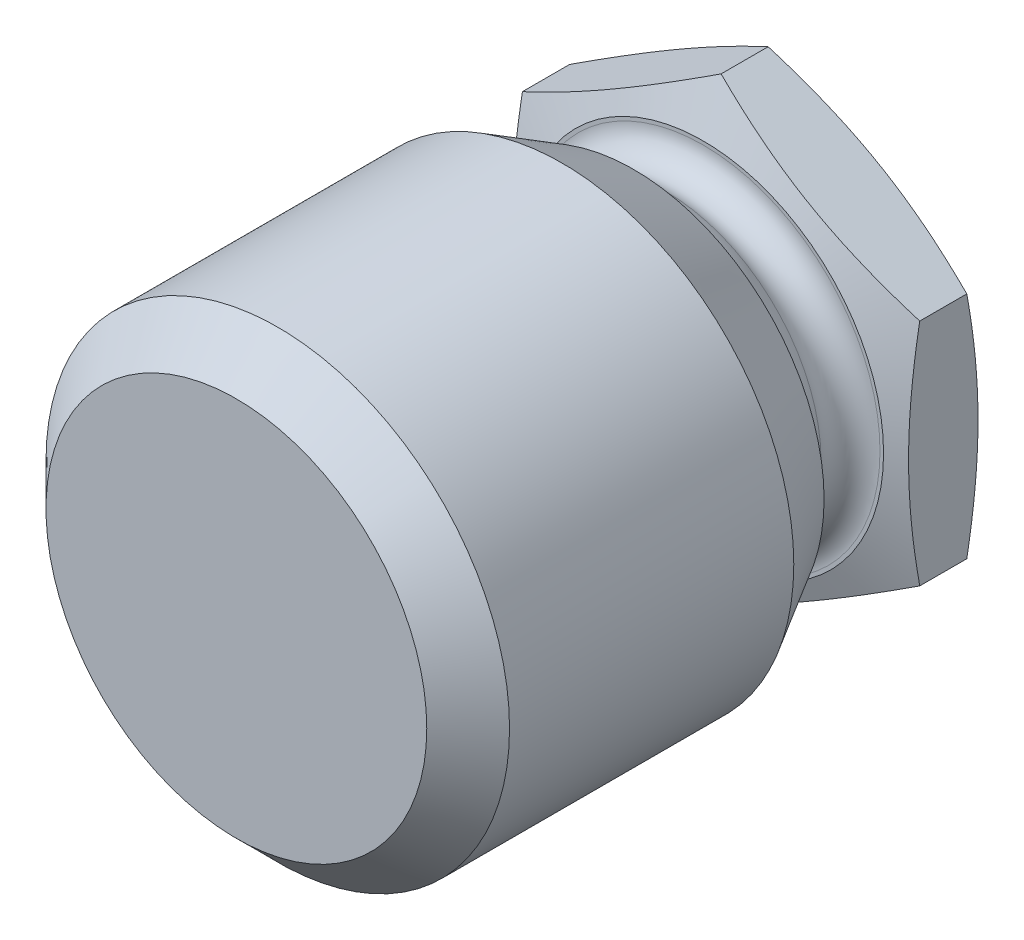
ISO-10303-21;
HEADER;
FILE_DESCRIPTION(('STEP AP214'),'2;1');
FILE_NAME('part.step','',(''),(''),'','','');
FILE_SCHEMA(('AUTOMOTIVE_DESIGN { 1 0 10303 214 1 1 1 1 }'));
ENDSEC;
DATA;
#1=APPLICATION_CONTEXT('core data for automotive mechanical design processes');
#2=APPLICATION_PROTOCOL_DEFINITION('international standard','automotive_design',2000,#1);
#3=PRODUCT_CONTEXT('',#1,'mechanical');
#4=PRODUCT('Part','Part','',(#3));
#5=PRODUCT_RELATED_PRODUCT_CATEGORY('part','',(#4));
#6=PRODUCT_DEFINITION_FORMATION('','',#4);
#7=PRODUCT_DEFINITION_CONTEXT('part definition',#1,'design');
#8=PRODUCT_DEFINITION('design','',#6,#7);
#9=PRODUCT_DEFINITION_SHAPE('','',#8);
#10=(LENGTH_UNIT() NAMED_UNIT(*) SI_UNIT(.MILLI.,.METRE.));
#11=(NAMED_UNIT(*) PLANE_ANGLE_UNIT() SI_UNIT($,.RADIAN.));
#12=(NAMED_UNIT(*) SI_UNIT($,.STERADIAN.) SOLID_ANGLE_UNIT());
#13=UNCERTAINTY_MEASURE_WITH_UNIT(LENGTH_MEASURE(1.E-05),#10,'distance_accuracy_value','');
#14=(GEOMETRIC_REPRESENTATION_CONTEXT(3) GLOBAL_UNCERTAINTY_ASSIGNED_CONTEXT((#13)) GLOBAL_UNIT_ASSIGNED_CONTEXT((#10,
#11,#12)) REPRESENTATION_CONTEXT('',''));
#15=CARTESIAN_POINT('',(0.,0.,0.));
#16=DIRECTION('',(0.,0.,1.));
#17=DIRECTION('',(1.,0.,0.));
#18=AXIS2_PLACEMENT_3D('',#15,#16,#17);
#19=CARTESIAN_POINT('',(0.,0.,3.9211552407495));
#20=DIRECTION('',(0.,0.,-1.));
#21=DIRECTION('',(-1.,0.,0.));
#22=AXIS2_PLACEMENT_3D('',#19,#20,#21);
#23=CONICAL_SURFACE('',#22,13.856406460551,1.22173047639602);
#24=CARTESIAN_POINT('',(0.,0.,5.));
#25=DIRECTION('',(0.,0.,1.));
#26=DIRECTION('',(1.,0.,0.));
#27=AXIS2_PLACEMENT_3D('',#24,#25,#26);
#28=CIRCLE('',#27,10.8923048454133);
#29=CARTESIAN_POINT('',(10.8923048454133,0.,5.));
#30=VERTEX_POINT('',#29);
#31=EDGE_CURVE('E205',#30,#30,#28,.T.);
#32=ORIENTED_EDGE('',*,*,#31,.F.);
#33=EDGE_LOOP('',(#32));
#34=FACE_BOUND('',#33,.T.);
#35=CARTESIAN_POINT('',(-12.0002,6.92808776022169,3.92111321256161));
#36=CARTESIAN_POINT('',(-11.5032371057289,7.21500942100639,4.02558110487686));
#37=CARTESIAN_POINT('',(-11.0046354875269,7.5028771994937,4.1206125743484));
#38=CARTESIAN_POINT('',(-10.0041904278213,8.08048442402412,4.28780554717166));
#39=CARTESIAN_POINT('',(-9.50234476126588,8.37022515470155,4.35994915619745));
#40=CARTESIAN_POINT('',(-8.50098069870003,8.94836296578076,4.47663930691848));
#41=CARTESIAN_POINT('',(-8.00148516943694,9.23674684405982,4.52144035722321));
#42=CARTESIAN_POINT('',(-7.00132608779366,9.81418895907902,4.5815311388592));
#43=CARTESIAN_POINT('',(-6.50066304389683,10.1032469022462,4.59683193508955));
#44=CARTESIAN_POINT('',(-5.49933695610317,10.6813627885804,4.59683193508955));
#45=CARTESIAN_POINT('',(-4.99867391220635,10.9704207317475,4.5815311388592));
#46=CARTESIAN_POINT('',(-3.99851483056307,11.5478628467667,4.52144035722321));
#47=CARTESIAN_POINT('',(-3.49901930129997,11.8362467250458,4.47663930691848));
#48=CARTESIAN_POINT('',(-2.49765523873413,12.414384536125,4.35994915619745));
#49=CARTESIAN_POINT('',(-1.99580957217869,12.7041252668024,4.28780554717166));
#50=CARTESIAN_POINT('',(-0.995364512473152,13.2817324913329,4.1206125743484));
#51=CARTESIAN_POINT('',(-0.496762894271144,13.5696002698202,4.02558110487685));
#52=CARTESIAN_POINT('',(0.000200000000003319,13.8565219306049,3.9211132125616));
#53=B_SPLINE_CURVE_WITH_KNOTS('',3,(#35,#36,#37,#38,#39,#40,#41,#42,#43,#44,#45,#46,#47,#48,#49,
#50,#51,#52),.UNSPECIFIED.,.F.,.F.,(4,2,2,2,2,2,2,2,4),(0.,1.75000540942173,3.50137566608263,
5.23618486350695,6.97034324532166,8.70450162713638,10.4393108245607,12.1906810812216,
13.9406864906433),.UNSPECIFIED.);
#54=CARTESIAN_POINT('',(-12.,6.92820323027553,3.9211552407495));
#55=VERTEX_POINT('',#54);
#56=CARTESIAN_POINT('',(0.,13.856406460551,3.9211552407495));
#57=VERTEX_POINT('',#56);
#58=EDGE_CURVE('E9',#55,#57,#53,.T.);
#59=ORIENTED_EDGE('',*,*,#58,.F.);
#60=CARTESIAN_POINT('',(-12.,-18.305065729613,0.99797002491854));
#61=CARTESIAN_POINT('',(-12.,-17.7625333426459,1.16306692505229));
#62=CARTESIAN_POINT('',(-12.,-17.2194011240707,1.32622882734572));
#63=CARTESIAN_POINT('',(-12.,-16.1316317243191,1.6476120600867));
#64=CARTESIAN_POINT('',(-12.,-15.5869944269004,1.8058329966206));
#65=CARTESIAN_POINT('',(-12.,-14.4949689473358,2.11652926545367));
#66=CARTESIAN_POINT('',(-12.,-13.9475775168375,2.26899322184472));
#67=CARTESIAN_POINT('',(-12.,-12.8507529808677,2.5663805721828));
#68=CARTESIAN_POINT('',(-12.,-12.301319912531,2.71130410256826));
#69=CARTESIAN_POINT('',(-12.,-11.2069100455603,2.98999588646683));
#70=CARTESIAN_POINT('',(-12.,-10.6619630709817,3.12388067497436));
#71=CARTESIAN_POINT('',(-12.,-9.569353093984,3.38019358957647));
#72=CARTESIAN_POINT('',(-12.,-9.02169004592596,3.50262152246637));
#73=CARTESIAN_POINT('',(-12.,-7.92353237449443,3.73315402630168));
#74=CARTESIAN_POINT('',(-12.,-7.37303881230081,3.84126360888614));
#75=CARTESIAN_POINT('',(-12.,-6.2688577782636,4.03985697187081));
#76=CARTESIAN_POINT('',(-12.,-5.71517041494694,4.13034134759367));
#77=CARTESIAN_POINT('',(-12.,-4.66701767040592,4.28103695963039));
#78=CARTESIAN_POINT('',(-12.,-4.17287996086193,4.34350607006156));
#79=CARTESIAN_POINT('',(-12.,-3.18252682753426,4.44912346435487));
#80=CARTESIAN_POINT('',(-12.,-2.68631146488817,4.49227231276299));
#81=CARTESIAN_POINT('',(-12.,-1.69281028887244,4.55717064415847));
#82=CARTESIAN_POINT('',(-12.,-1.19552547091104,4.57893512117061));
#83=CARTESIAN_POINT('',(-12.,-0.20047517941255,4.59996390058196));
#84=CARTESIAN_POINT('',(-12.,0.297290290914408,4.59922835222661));
#85=CARTESIAN_POINT('',(-12.,1.29482690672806,4.57523572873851));
#86=CARTESIAN_POINT('',(-12.,1.79459522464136,4.55186301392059));
#87=CARTESIAN_POINT('',(-12.,2.79265377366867,4.48367021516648));
#88=CARTESIAN_POINT('',(-12.,3.29094396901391,4.4388496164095));
#89=CARTESIAN_POINT('',(-12.,4.28580450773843,4.32984964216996));
#90=CARTESIAN_POINT('',(-12.,4.78237300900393,4.26565369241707));
#91=CARTESIAN_POINT('',(-12.,5.77302546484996,4.12049574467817));
#92=CARTESIAN_POINT('',(-12.,6.2671094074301,4.03953366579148));
#93=CARTESIAN_POINT('',(-12.,7.2820095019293,3.85823532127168));
#94=CARTESIAN_POINT('',(-12.,7.80266971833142,3.75703373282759));
#95=CARTESIAN_POINT('',(-12.,8.84130567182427,3.54160494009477));
#96=CARTESIAN_POINT('',(-12.,9.3592812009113,3.42737674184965));
#97=CARTESIAN_POINT('',(-12.,10.3929223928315,3.18830552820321));
#98=CARTESIAN_POINT('',(-12.,10.9085873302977,3.06345939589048));
#99=CARTESIAN_POINT('',(-12.,11.9377411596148,2.80519083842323));
#100=CARTESIAN_POINT('',(-12.,12.4512301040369,2.67176862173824));
#101=CARTESIAN_POINT('',(-12.,13.4770029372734,2.39778093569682));
#102=CARTESIAN_POINT('',(-12.,13.9892844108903,2.25720645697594));
#103=CARTESIAN_POINT('',(-12.,15.0122475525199,1.97035993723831));
#104=CARTESIAN_POINT('',(-12.,15.5229292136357,1.82408787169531));
#105=CARTESIAN_POINT('',(-12.,16.542838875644,1.52689507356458));
#106=CARTESIAN_POINT('',(-12.,17.0520671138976,1.37597515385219));
#107=CARTESIAN_POINT('',(-12.,18.069362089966,1.07026585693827));
#108=CARTESIAN_POINT('',(-12.,18.5774288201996,0.915476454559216));
#109=CARTESIAN_POINT('',(-12.,20.0886046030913,0.449863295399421));
#110=CARTESIAN_POINT('',(-12.,21.0902784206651,0.13438235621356));
#111=CARTESIAN_POINT('',(-12.,23.0908238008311,-0.505463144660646));
#112=CARTESIAN_POINT('',(-12.,24.0896952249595,-0.829828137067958));
#113=CARTESIAN_POINT('',(-12.,26.0815019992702,-1.48382223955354));
#114=CARTESIAN_POINT('',(-12.,27.0744454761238,-1.81342663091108));
#115=CARTESIAN_POINT('',(-12.,28.5625980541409,-2.31146322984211));
#116=CARTESIAN_POINT('',(-12.,29.0584184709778,-2.47807362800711));
#117=CARTESIAN_POINT('',(-12.,30.0496971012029,-2.81236469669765));
#118=CARTESIAN_POINT('',(-12.,30.5451553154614,-2.98004536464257));
#119=CARTESIAN_POINT('',(-12.,31.0404562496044,-3.14818956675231));
#120=B_SPLINE_CURVE_WITH_KNOTS('',3,(#60,#61,#62,#63,#64,#65,#66,#67,#68,#69,#70,#71,#72,#73,
#74,#75,#76,#77,#78,#79,#80,#81,#82,#83,#84,#85,#86,#87,#88,#89,#90,#91,#92,#93,#94,#95,#96,#97,
#98,#99,#100,#101,#102,#103,#104,#105,#106,#107,#108,#109,#110,#111,#112,#113,#114,#115,#116,
#117,#118,#119),.UNSPECIFIED.,.F.,.F.,(4,2,2,2,2,2,2,2,2,2,2,2,2,2,2,2,2,2,2,2,2,2,2,2,2,2,2,2,
2,4),(0.,1.70130148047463,3.40273825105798,5.10737773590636,6.81198636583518,8.49534656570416,
10.1787351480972,11.8615329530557,13.5442739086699,15.0381570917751,16.5319966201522,
18.0247879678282,19.5175694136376,21.0180170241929,22.5185006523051,24.0202714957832,
25.5220495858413,27.1130578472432,28.7041875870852,30.295786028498,31.8873457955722,
33.4809625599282,35.0745861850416,36.6679326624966,38.2612895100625,41.4117629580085,
44.5623894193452,47.701030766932,49.270224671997,50.8394147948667),.UNSPECIFIED.);
#121=CARTESIAN_POINT('',(-12.,-6.9282032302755,3.9211552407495));
#122=VERTEX_POINT('',#121);
#123=EDGE_CURVE('E28',#122,#55,#120,.T.);
#124=ORIENTED_EDGE('',*,*,#123,.F.);
#125=CARTESIAN_POINT('',(0.00020000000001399,-13.8565219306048,3.92111321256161));
#126=CARTESIAN_POINT('',(-0.496762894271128,-13.5696002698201,4.02558110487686));
#127=CARTESIAN_POINT('',(-0.995364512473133,-13.2817324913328,4.12061257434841));
#128=CARTESIAN_POINT('',(-1.99580957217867,-12.7041252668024,4.28780554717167));
#129=CARTESIAN_POINT('',(-2.49765523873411,-12.414384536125,4.35994915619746));
#130=CARTESIAN_POINT('',(-3.49901930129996,-11.8362467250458,4.4766393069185));
#131=CARTESIAN_POINT('',(-3.99851483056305,-11.5478628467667,4.52144035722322));
#132=CARTESIAN_POINT('',(-4.99867391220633,-10.9704207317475,4.58153113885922));
#133=CARTESIAN_POINT('',(-5.49933695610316,-10.6813627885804,4.59683193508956));
#134=CARTESIAN_POINT('',(-6.50066304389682,-10.1032469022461,4.59683193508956));
#135=CARTESIAN_POINT('',(-7.00132608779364,-9.81418895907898,4.58153113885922));
#136=CARTESIAN_POINT('',(-8.00148516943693,-9.23674684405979,4.52144035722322));
#137=CARTESIAN_POINT('',(-8.50098069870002,-8.94836296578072,4.4766393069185));
#138=CARTESIAN_POINT('',(-9.50234476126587,-8.37022515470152,4.35994915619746));
#139=CARTESIAN_POINT('',(-10.0041904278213,-8.08048442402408,4.28780554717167));
#140=CARTESIAN_POINT('',(-11.0046354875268,-7.50287719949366,4.12061257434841));
#141=CARTESIAN_POINT('',(-11.5032371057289,-7.21500942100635,4.02558110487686));
#142=CARTESIAN_POINT('',(-12.0002,-6.92808776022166,3.92111321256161));
#143=B_SPLINE_CURVE_WITH_KNOTS('',3,(#125,#126,#127,#128,#129,#130,#131,#132,#133,#134,#135,
#136,#137,#138,#139,#140,#141,#142),.UNSPECIFIED.,.F.,.F.,(4,2,2,2,2,2,2,2,4),(0.,
1.75000540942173,3.50137566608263,5.23618486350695,6.97034324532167,8.70450162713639,
10.4393108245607,12.1906810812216,13.9406864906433),.UNSPECIFIED.);
#144=CARTESIAN_POINT('',(0.,-13.856406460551,3.9211552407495));
#145=VERTEX_POINT('',#144);
#146=EDGE_CURVE('E90',#145,#122,#143,.T.);
#147=ORIENTED_EDGE('',*,*,#146,.F.);
#148=CARTESIAN_POINT('',(12.0002,-6.92808776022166,3.92111321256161));
#149=CARTESIAN_POINT('',(11.5032371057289,-7.21500942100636,4.02558110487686));
#150=CARTESIAN_POINT('',(11.0046354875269,-7.50287719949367,4.1206125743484));
#151=CARTESIAN_POINT('',(10.0041904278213,-8.08048442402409,4.28780554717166));
#152=CARTESIAN_POINT('',(9.50234476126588,-8.37022515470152,4.35994915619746));
#153=CARTESIAN_POINT('',(8.50098069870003,-8.94836296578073,4.47663930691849));
#154=CARTESIAN_POINT('',(8.00148516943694,-9.23674684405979,4.52144035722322));
#155=CARTESIAN_POINT('',(7.00132608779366,-9.81418895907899,4.58153113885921));
#156=CARTESIAN_POINT('',(6.50066304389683,-10.1032469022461,4.59683193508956));
#157=CARTESIAN_POINT('',(5.49933695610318,-10.6813627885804,4.59683193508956));
#158=CARTESIAN_POINT('',(4.99867391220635,-10.9704207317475,4.58153113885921));
#159=CARTESIAN_POINT('',(3.99851483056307,-11.5478628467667,4.52144035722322));
#160=CARTESIAN_POINT('',(3.49901930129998,-11.8362467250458,4.47663930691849));
#161=CARTESIAN_POINT('',(2.49765523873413,-12.414384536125,4.35994915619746));
#162=CARTESIAN_POINT('',(1.99580957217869,-12.7041252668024,4.28780554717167));
#163=CARTESIAN_POINT('',(0.995364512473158,-13.2817324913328,4.12061257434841));
#164=CARTESIAN_POINT('',(0.496762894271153,-13.5696002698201,4.02558110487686));
#165=CARTESIAN_POINT('',(-0.000199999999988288,-13.8565219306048,3.92111321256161));
#166=B_SPLINE_CURVE_WITH_KNOTS('',3,(#148,#149,#150,#151,#152,#153,#154,#155,#156,#157,#158,
#159,#160,#161,#162,#163,#164,#165),.UNSPECIFIED.,.F.,.F.,(4,2,2,2,2,2,2,2,4),(0.,
1.75000540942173,3.50137566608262,5.23618486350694,6.97034324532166,8.70450162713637,
10.4393108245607,12.1906810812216,13.9406864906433),.UNSPECIFIED.);
#167=CARTESIAN_POINT('',(12.,-6.9282032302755,3.9211552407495));
#168=VERTEX_POINT('',#167);
#169=EDGE_CURVE('E88',#168,#145,#166,.T.);
#170=ORIENTED_EDGE('',*,*,#169,.F.);
#171=CARTESIAN_POINT('',(12.,-18.305065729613,0.99797002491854));
#172=CARTESIAN_POINT('',(12.,-17.7625333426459,1.16306692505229));
#173=CARTESIAN_POINT('',(12.,-17.2194011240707,1.32622882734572));
#174=CARTESIAN_POINT('',(12.,-16.1316317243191,1.6476120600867));
#175=CARTESIAN_POINT('',(12.,-15.5869944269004,1.8058329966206));
#176=CARTESIAN_POINT('',(12.,-14.4949689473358,2.11652926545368));
#177=CARTESIAN_POINT('',(12.,-13.9475775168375,2.26899322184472));
#178=CARTESIAN_POINT('',(12.,-12.8507529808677,2.56638057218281));
#179=CARTESIAN_POINT('',(12.,-12.301319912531,2.71130410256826));
#180=CARTESIAN_POINT('',(12.,-11.2069100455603,2.98999588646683));
#181=CARTESIAN_POINT('',(12.,-10.6619630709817,3.12388067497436));
#182=CARTESIAN_POINT('',(12.,-9.569353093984,3.38019358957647));
#183=CARTESIAN_POINT('',(12.,-9.02169004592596,3.50262152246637));
#184=CARTESIAN_POINT('',(12.,-7.92353237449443,3.73315402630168));
#185=CARTESIAN_POINT('',(12.,-7.37303881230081,3.84126360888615));
#186=CARTESIAN_POINT('',(12.,-6.2688577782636,4.0398569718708));
#187=CARTESIAN_POINT('',(12.,-5.71517041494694,4.13034134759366));
#188=CARTESIAN_POINT('',(12.,-4.66701767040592,4.28103695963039));
#189=CARTESIAN_POINT('',(12.,-4.17287996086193,4.34350607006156));
#190=CARTESIAN_POINT('',(12.,-3.18252682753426,4.44912346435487));
#191=CARTESIAN_POINT('',(12.,-2.68631146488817,4.49227231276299));
#192=CARTESIAN_POINT('',(12.,-1.69281028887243,4.55717064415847));
#193=CARTESIAN_POINT('',(12.,-1.19552547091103,4.57893512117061));
#194=CARTESIAN_POINT('',(12.,-0.200475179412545,4.59996390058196));
#195=CARTESIAN_POINT('',(12.,0.297290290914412,4.59922835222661));
#196=CARTESIAN_POINT('',(12.,1.29482690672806,4.57523572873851));
#197=CARTESIAN_POINT('',(12.,1.79459522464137,4.55186301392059));
#198=CARTESIAN_POINT('',(12.,2.79265377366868,4.48367021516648));
#199=CARTESIAN_POINT('',(12.,3.29094396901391,4.4388496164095));
#200=CARTESIAN_POINT('',(12.,4.28580450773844,4.32984964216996));
#201=CARTESIAN_POINT('',(12.,4.78237300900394,4.26565369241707));
#202=CARTESIAN_POINT('',(12.,5.77302546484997,4.12049574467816));
#203=CARTESIAN_POINT('',(12.,6.26710940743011,4.03953366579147));
#204=CARTESIAN_POINT('',(12.,7.28200950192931,3.85823532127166));
#205=CARTESIAN_POINT('',(12.,7.80266971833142,3.75703373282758));
#206=CARTESIAN_POINT('',(12.,8.84130567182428,3.54160494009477));
#207=CARTESIAN_POINT('',(12.,9.35928120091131,3.42737674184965));
#208=CARTESIAN_POINT('',(12.,10.3929223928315,3.18830552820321));
#209=CARTESIAN_POINT('',(12.,10.9085873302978,3.06345939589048));
#210=CARTESIAN_POINT('',(12.,11.9377411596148,2.80519083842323));
#211=CARTESIAN_POINT('',(12.,12.4512301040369,2.67176862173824));
#212=CARTESIAN_POINT('',(12.,13.4770029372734,2.39778093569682));
#213=CARTESIAN_POINT('',(12.,13.9892844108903,2.25720645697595));
#214=CARTESIAN_POINT('',(12.,15.0122475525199,1.97035993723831));
#215=CARTESIAN_POINT('',(12.,15.5229292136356,1.82408787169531));
#216=CARTESIAN_POINT('',(12.,16.542838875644,1.52689507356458));
#217=CARTESIAN_POINT('',(12.,17.0520671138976,1.37597515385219));
#218=CARTESIAN_POINT('',(12.,18.069362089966,1.07026585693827));
#219=CARTESIAN_POINT('',(12.,18.5774288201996,0.915476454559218));
#220=CARTESIAN_POINT('',(12.,20.0886046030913,0.449863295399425));
#221=CARTESIAN_POINT('',(12.,21.0902784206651,0.134382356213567));
#222=CARTESIAN_POINT('',(12.,23.0908238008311,-0.505463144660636));
#223=CARTESIAN_POINT('',(12.,24.0896952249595,-0.829828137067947));
#224=CARTESIAN_POINT('',(12.,26.0815019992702,-1.48382223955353));
#225=CARTESIAN_POINT('',(12.,27.0744454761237,-1.81342663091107));
#226=CARTESIAN_POINT('',(12.,28.5625980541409,-2.3114632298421));
#227=CARTESIAN_POINT('',(12.,29.0584184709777,-2.47807362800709));
#228=CARTESIAN_POINT('',(12.,30.0496971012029,-2.81236469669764));
#229=CARTESIAN_POINT('',(12.,30.5451553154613,-2.98004536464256));
#230=CARTESIAN_POINT('',(12.,31.0404562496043,-3.14818956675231));
#231=B_SPLINE_CURVE_WITH_KNOTS('',3,(#171,#172,#173,#174,#175,#176,#177,#178,#179,#180,#181,
#182,#183,#184,#185,#186,#187,#188,#189,#190,#191,#192,#193,#194,#195,#196,#197,#198,#199,#200,
#201,#202,#203,#204,#205,#206,#207,#208,#209,#210,#211,#212,#213,#214,#215,#216,#217,#218,#219,
#220,#221,#222,#223,#224,#225,#226,#227,#228,#229,#230),.UNSPECIFIED.,.F.,.F.,(4,2,2,2,2,2,2,2,
2,2,2,2,2,2,2,2,2,2,2,2,2,2,2,2,2,2,2,2,2,4),(0.,1.70130148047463,3.40273825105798,
5.10737773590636,6.81198636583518,8.49534656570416,10.1787351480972,11.8615329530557,
13.5442739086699,15.0381570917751,16.5319966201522,18.0247879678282,19.5175694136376,
21.0180170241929,22.5185006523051,24.0202714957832,25.5220495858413,27.1130578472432,
28.7041875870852,30.295786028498,31.8873457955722,33.4809625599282,35.0745861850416,
36.6679326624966,38.2612895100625,41.4117629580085,44.5623894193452,47.701030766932,
49.270224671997,50.8394147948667),.UNSPECIFIED.);
#232=CARTESIAN_POINT('',(12.,6.92820323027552,3.9211552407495));
#233=VERTEX_POINT('',#232);
#234=EDGE_CURVE('E74',#233,#168,#231,.F.);
#235=ORIENTED_EDGE('',*,*,#234,.F.);
#236=CARTESIAN_POINT('',(-0.000200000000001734,13.8565219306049,3.9211132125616));
#237=CARTESIAN_POINT('',(0.496762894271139,13.5696002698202,4.02558110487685));
#238=CARTESIAN_POINT('',(0.995364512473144,13.2817324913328,4.1206125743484));
#239=CARTESIAN_POINT('',(1.99580957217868,12.7041252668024,4.28780554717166));
#240=CARTESIAN_POINT('',(2.49765523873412,12.414384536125,4.35994915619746));
#241=CARTESIAN_POINT('',(3.49901930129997,11.8362467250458,4.47663930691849));
#242=CARTESIAN_POINT('',(3.99851483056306,11.5478628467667,4.52144035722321));
#243=CARTESIAN_POINT('',(4.99867391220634,10.9704207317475,4.58153113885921));
#244=CARTESIAN_POINT('',(5.49933695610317,10.6813627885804,4.59683193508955));
#245=CARTESIAN_POINT('',(6.50066304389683,10.1032469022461,4.59683193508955));
#246=CARTESIAN_POINT('',(7.00132608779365,9.814188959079,4.58153113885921));
#247=CARTESIAN_POINT('',(8.00148516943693,9.23674684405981,4.52144035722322));
#248=CARTESIAN_POINT('',(8.50098069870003,8.94836296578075,4.47663930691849));
#249=CARTESIAN_POINT('',(9.50234476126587,8.37022515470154,4.35994915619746));
#250=CARTESIAN_POINT('',(10.0041904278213,8.0804844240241,4.28780554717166));
#251=CARTESIAN_POINT('',(11.0046354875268,7.50287719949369,4.1206125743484));
#252=CARTESIAN_POINT('',(11.5032371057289,7.21500942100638,4.02558110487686));
#253=CARTESIAN_POINT('',(12.0002,6.92808776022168,3.92111321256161));
#254=B_SPLINE_CURVE_WITH_KNOTS('',3,(#236,#237,#238,#239,#240,#241,#242,#243,#244,#245,#246,
#247,#248,#249,#250,#251,#252,#253),.UNSPECIFIED.,.F.,.F.,(4,2,2,2,2,2,2,2,4),(0.,
1.75000540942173,3.50137566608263,5.23618486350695,6.97034324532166,8.70450162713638,
10.4393108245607,12.1906810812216,13.9406864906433),.UNSPECIFIED.);
#255=EDGE_CURVE('E69',#57,#233,#254,.T.);
#256=ORIENTED_EDGE('',*,*,#255,.F.);
#257=EDGE_LOOP('',(#59,#124,#147,#170,#235,#256));
#258=FACE_BOUND('',#257,.T.);
#259=ADVANCED_FACE('F14',(#34,#258),#23,.T.);
#260=CARTESIAN_POINT('',(0.,0.,33.2000012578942));
#261=DIRECTION('',(0.,0.,-1.));
#262=DIRECTION('',(-1.,0.,0.));
#263=AXIS2_PLACEMENT_3D('',#260,#261,#262);
#264=PLANE('',#263);
#265=CARTESIAN_POINT('',(0.,0.,33.2000025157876));
#266=DIRECTION('',(0.,0.,1.));
#267=DIRECTION('',(1.,0.,0.));
#268=AXIS2_PLACEMENT_3D('',#265,#266,#267);
#269=CIRCLE('',#268,11.4999999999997);
#270=CARTESIAN_POINT('',(11.4999999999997,0.,33.2000025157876));
#271=VERTEX_POINT('',#270);
#272=EDGE_CURVE('E163',#271,#271,#269,.T.);
#273=ORIENTED_EDGE('',*,*,#272,.T.);
#274=EDGE_LOOP('',(#273));
#275=FACE_BOUND('',#274,.T.);
#276=ADVANCED_FACE('F16',(#275),#264,.F.);
#277=CARTESIAN_POINT('',(0.,10.6770782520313,5.));
#278=DIRECTION('',(0.,0.,-1.));
#279=DIRECTION('',(-1.,0.,0.));
#280=AXIS2_PLACEMENT_3D('',#277,#278,#279);
#281=PLANE('',#280);
#282=CARTESIAN_POINT('',(0.,0.,5.));
#283=DIRECTION('',(0.,0.,1.));
#284=DIRECTION('',(1.,0.,0.));
#285=AXIS2_PLACEMENT_3D('',#282,#283,#284);
#286=CIRCLE('',#285,10.6770782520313);
#287=CARTESIAN_POINT('',(10.6770782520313,0.,5.));
#288=VERTEX_POINT('',#287);
#289=EDGE_CURVE('E204',#288,#288,#286,.T.);
#290=ORIENTED_EDGE('',*,*,#289,.F.);
#291=EDGE_LOOP('',(#290));
#292=FACE_BOUND('',#291,.T.);
#293=ORIENTED_EDGE('',*,*,#31,.T.);
#294=EDGE_LOOP('',(#293));
#295=FACE_BOUND('',#294,.T.);
#296=ADVANCED_FACE('F115',(#292,#295),#281,.F.);
#297=CARTESIAN_POINT('',(0.,0.,6.5));
#298=DIRECTION('',(0.,0.,1.));
#299=DIRECTION('',(1.,0.,0.));
#300=AXIS2_PLACEMENT_3D('',#297,#298,#299);
#301=TOROIDAL_SURFACE('',#300,10.6770782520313,1.5);
#302=CARTESIAN_POINT('',(0.,0.,7.28));
#303=DIRECTION('',(0.,0.,1.));
#304=DIRECTION('',(1.,0.,0.));
#305=AXIS2_PLACEMENT_3D('',#302,#303,#304);
#306=CIRCLE('',#305,9.39582886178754);
#307=CARTESIAN_POINT('',(0.,9.39582886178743,7.28));
#308=VERTEX_POINT('',#307);
#309=EDGE_CURVE('E201',#308,#308,#306,.T.);
#310=ORIENTED_EDGE('',*,*,#309,.F.);
#311=EDGE_LOOP('',(#310));
#312=FACE_BOUND('',#311,.T.);
#313=ORIENTED_EDGE('',*,*,#289,.T.);
#314=EDGE_LOOP('',(#313));
#315=FACE_BOUND('',#314,.T.);
#316=ADVANCED_FACE('F189',(#312,#315),#301,.F.);
#317=CARTESIAN_POINT('',(0.,0.,13.0000000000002));
#318=DIRECTION('',(0.,0.,1.));
#319=DIRECTION('',(0.,1.,0.));
#320=AXIS2_PLACEMENT_3D('',#317,#318,#319);
#321=SPHERICAL_SURFACE('',#320,11.);
#322=CARTESIAN_POINT('',(0.,0.,9.2));
#323=DIRECTION('',(0.,0.,1.));
#324=DIRECTION('',(1.,0.,0.));
#325=AXIS2_PLACEMENT_3D('',#322,#323,#324);
#326=CIRCLE('',#325,10.3227903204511);
#327=CARTESIAN_POINT('',(0.,10.3227903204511,9.2));
#328=VERTEX_POINT('',#327);
#329=EDGE_CURVE('E210',#328,#328,#326,.T.);
#330=CARTESIAN_POINT('',(0.,10.3227903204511,9.2));
#331=CARTESIAN_POINT('',(0.,10.3151060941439,9.17912561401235));
#332=CARTESIAN_POINT('',(0.,10.307358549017,9.15827453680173));
#333=CARTESIAN_POINT('',(0.,10.2917371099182,9.11661976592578));
#334=CARTESIAN_POINT('',(0.,10.2838632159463,9.09581607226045));
#335=CARTESIAN_POINT('',(0.,10.267989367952,9.05425683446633));
#336=CARTESIAN_POINT('',(0.,10.2599894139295,9.03350129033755));
#337=CARTESIAN_POINT('',(0.,10.2438637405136,8.9920391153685));
#338=CARTESIAN_POINT('',(0.,10.2357380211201,8.97133248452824));
#339=CARTESIAN_POINT('',(0.,10.2193611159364,8.92996889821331));
#340=CARTESIAN_POINT('',(0.,10.2111099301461,8.90931194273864));
#341=CARTESIAN_POINT('',(0.,10.1944823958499,8.86804846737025));
#342=CARTESIAN_POINT('',(0.,10.186106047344,8.84744194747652));
#343=CARTESIAN_POINT('',(0.,10.1692284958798,8.80628010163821));
#344=CARTESIAN_POINT('',(0.,10.1607272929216,8.78572477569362));
#345=CARTESIAN_POINT('',(0.,10.1436003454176,8.74466607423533));
#346=CARTESIAN_POINT('',(0.,10.1349746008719,8.72416269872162));
#347=CARTESIAN_POINT('',(0.,10.1175988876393,8.68320865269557));
#348=CARTESIAN_POINT('',(0.,10.1088489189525,8.66275798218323));
#349=CARTESIAN_POINT('',(0.,10.0912250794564,8.62191009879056));
#350=CARTESIAN_POINT('',(0.,10.0823512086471,8.60151288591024));
#351=CARTESIAN_POINT('',(0.,10.0644798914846,8.56077266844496));
#352=CARTESIAN_POINT('',(0.,10.0554824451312,8.54042966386));
#353=CARTESIAN_POINT('',(0.,10.0373643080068,8.49979861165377));
#354=CARTESIAN_POINT('',(0.,10.0282436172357,8.47951056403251));
#355=CARTESIAN_POINT('',(0.,10.0098793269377,8.43899017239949));
#356=CARTESIAN_POINT('',(0.,10.0006357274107,8.41875782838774));
#357=CARTESIAN_POINT('',(0.,9.98202595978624,8.3783495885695));
#358=CARTESIAN_POINT('',(0.,9.97265979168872,8.35817369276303));
#359=CARTESIAN_POINT('',(0.,9.95380523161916,8.31787909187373));
#360=CARTESIAN_POINT('',(0.,9.94431683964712,8.29776038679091));
#361=CARTESIAN_POINT('',(0.,9.9252181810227,8.25758090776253));
#362=CARTESIAN_POINT('',(0.,9.91560791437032,8.23752013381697));
#363=CARTESIAN_POINT('',(0.,9.89626586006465,8.19745725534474));
#364=CARTESIAN_POINT('',(0.,9.88653407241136,8.17745515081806));
#365=CARTESIAN_POINT('',(0.,9.86694933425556,8.13751034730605));
#366=CARTESIAN_POINT('',(0.,9.85709638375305,8.11756764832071));
#367=CARTESIAN_POINT('',(0.,9.83726968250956,8.07774238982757));
#368=CARTESIAN_POINT('',(0.,9.82729593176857,8.05785983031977));
#369=CARTESIAN_POINT('',(0.,9.80722799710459,8.01815558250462));
#370=CARTESIAN_POINT('',(0.,9.7971338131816,7.99833389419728));
#371=CARTESIAN_POINT('',(0.,9.77682538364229,7.95875211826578));
#372=CARTESIAN_POINT('',(0.,9.76661113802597,7.93899203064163));
#373=CARTESIAN_POINT('',(0.,9.74606296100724,7.8995341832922));
#374=CARTESIAN_POINT('',(0.,9.73572902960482,7.87983642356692));
#375=CARTESIAN_POINT('',(0.,9.7149418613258,7.84050395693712));
#376=CARTESIAN_POINT('',(0.,9.7044886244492,7.8208692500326));
#377=CARTESIAN_POINT('',(0.,9.68346322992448,7.7816636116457));
#378=CARTESIAN_POINT('',(0.,9.67289107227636,7.76209268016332));
#379=CARTESIAN_POINT('',(0.,9.65162822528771,7.72301531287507));
#380=CARTESIAN_POINT('',(0.,9.64093753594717,7.70350887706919));
#381=CARTESIAN_POINT('',(0.,9.61943801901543,7.66456121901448));
#382=CARTESIAN_POINT('',(0.,9.60862919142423,7.64511999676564));
#383=CARTESIAN_POINT('',(0.,9.5868937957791,7.60630348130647));
#384=CARTESIAN_POINT('',(0.,9.57596722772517,7.58692818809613));
#385=CARTESIAN_POINT('',(0.,9.55399675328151,7.54824424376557));
#386=CARTESIAN_POINT('',(0.,9.54295284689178,7.52893559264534));
#387=CARTESIAN_POINT('',(0.,9.52074810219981,7.49038564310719));
#388=CARTESIAN_POINT('',(0.,9.50958726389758,7.47114434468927));
#389=CARTESIAN_POINT('',(0.,9.48714906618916,7.43272980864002));
#390=CARTESIAN_POINT('',(0.,9.47587170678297,7.41355657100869));
#391=CARTESIAN_POINT('',(0.,9.45320088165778,7.37527886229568));
#392=CARTESIAN_POINT('',(0.,9.44180741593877,7.35617439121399));
#393=CARTESIAN_POINT('',(0.,9.41890479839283,7.31803491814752));
#394=CARTESIAN_POINT('',(0.,9.40739564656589,7.29899991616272));
#395=CARTESIAN_POINT('',(0.,9.39582886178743,7.28));
#396=B_SPLINE_CURVE_WITH_KNOTS('',3,(#330,#331,#332,#333,#334,#335,#336,#337,#338,#339,#340,
#341,#342,#343,#344,#345,#346,#347,#348,#349,#350,#351,#352,#353,#354,#355,#356,#357,#358,#359,
#360,#361,#362,#363,#364,#365,#366,#367,#368,#369,#370,#371,#372,#373,#374,#375,#376,#377,#378,
#379,#380,#381,#382,#383,#384,#385,#386,#387,#388,#389,#390,#391,#392,#393,#394,#395),
.UNSPECIFIED.,.F.,.F.,(4,2,2,2,2,2,2,2,2,2,2,2,2,2,2,2,2,2,2,2,2,2,2,2,2,2,2,2,2,2,2,2,4),(0.,
0.0667313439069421,0.133462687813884,0.200194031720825,0.266925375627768,0.33365671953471,
0.400388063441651,0.467119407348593,0.533850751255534,0.600582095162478,0.667313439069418,
0.73404478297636,0.800776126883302,0.867507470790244,0.934238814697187,1.00097015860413,
1.06770150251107,1.13443284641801,1.20116419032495,1.26789553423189,1.33462687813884,
1.40135822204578,1.46808956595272,1.53482090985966,1.6015522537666,1.66828359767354,
1.73501494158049,1.80174628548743,1.86847762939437,1.93520897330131,2.00194031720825,
2.06867166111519,2.13540300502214),.UNSPECIFIED.);
#397=EDGE_CURVE('BSEAM186',#328,#308,#396,.T.);
#398=ORIENTED_EDGE('',*,*,#329,.F.);
#399=ORIENTED_EDGE('',*,*,#309,.T.);
#400=ORIENTED_EDGE('',*,*,#397,.T.);
#401=ORIENTED_EDGE('',*,*,#397,.F.);
#402=EDGE_LOOP('',(#398,#400,#399,#401));
#403=FACE_BOUND('',#402,.T.);
#404=ADVANCED_FACE('F186',(#403),#321,.T.);
#405=CARTESIAN_POINT('',(0.,11.5000052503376,9.20000125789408));
#406=DIRECTION('',(0.,0.,1.));
#407=DIRECTION('',(1.,0.,0.));
#408=AXIS2_PLACEMENT_3D('',#405,#406,#407);
#409=PLANE('',#408);
#410=CARTESIAN_POINT('',(0.,0.,9.20000251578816));
#411=DIRECTION('',(0.,0.,1.));
#412=DIRECTION('',(1.,0.,0.));
#413=AXIS2_PLACEMENT_3D('',#410,#411,#412);
#414=CIRCLE('',#413,11.5000052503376);
#415=CARTESIAN_POINT('',(11.5000052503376,0.,9.20000251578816));
#416=VERTEX_POINT('',#415);
#417=EDGE_CURVE('E425',#416,#416,#414,.T.);
#418=ORIENTED_EDGE('',*,*,#417,.F.);
#419=EDGE_LOOP('',(#418));
#420=FACE_BOUND('',#419,.T.);
#421=ORIENTED_EDGE('',*,*,#329,.T.);
#422=EDGE_LOOP('',(#421));
#423=FACE_BOUND('',#422,.T.);
#424=ADVANCED_FACE('F182',(#420,#423),#409,.F.);
#425=CARTESIAN_POINT('',(0.,0.,9.20000251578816));
#426=DIRECTION('',(0.,0.,1.));
#427=DIRECTION('',(1.,0.,0.));
#428=AXIS2_PLACEMENT_3D('',#425,#426,#427);
#429=CONICAL_SURFACE('',#428,11.5000052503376,0.523598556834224);
#430=CARTESIAN_POINT('',(0.,0.,13.5301300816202));
#431=DIRECTION('',(0.,0.,1.));
#432=DIRECTION('',(1.,0.,0.));
#433=AXIS2_PLACEMENT_3D('',#430,#431,#432);
#434=CIRCLE('',#433,14.0000043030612);
#435=CARTESIAN_POINT('',(14.0000043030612,0.,13.5301300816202));
#436=VERTEX_POINT('',#435);
#437=EDGE_CURVE('E421',#436,#436,#434,.T.);
#438=ORIENTED_EDGE('',*,*,#437,.F.);
#439=EDGE_LOOP('',(#438));
#440=FACE_BOUND('',#439,.T.);
#441=ORIENTED_EDGE('',*,*,#417,.T.);
#442=EDGE_LOOP('',(#441));
#443=FACE_BOUND('',#442,.T.);
#444=ADVANCED_FACE('F178',(#440,#443),#429,.T.);
#445=CARTESIAN_POINT('',(0.,0.,35.9859812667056));
#446=DIRECTION('',(0.,0.,1.));
#447=DIRECTION('',(1.,0.,0.));
#448=AXIS2_PLACEMENT_3D('',#445,#446,#447);
#449=CYLINDRICAL_SURFACE('',#448,14.0000024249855);
#450=CARTESIAN_POINT('',(0.,0.,30.7000030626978));
#451=DIRECTION('',(0.,0.,1.));
#452=DIRECTION('',(1.,0.,0.));
#453=AXIS2_PLACEMENT_3D('',#450,#451,#452);
#454=CIRCLE('',#453,14.0000005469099);
#455=CARTESIAN_POINT('',(14.0000005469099,0.,30.7000030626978));
#456=VERTEX_POINT('',#455);
#457=EDGE_CURVE('E419',#456,#456,#454,.T.);
#458=ORIENTED_EDGE('',*,*,#457,.F.);
#459=EDGE_LOOP('',(#458));
#460=FACE_BOUND('',#459,.T.);
#461=ORIENTED_EDGE('',*,*,#437,.T.);
#462=EDGE_LOOP('',(#461));
#463=FACE_BOUND('',#462,.T.);
#464=ADVANCED_FACE('F174',(#460,#463),#449,.T.);
#465=CARTESIAN_POINT('',(0.,0.,30.7000030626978));
#466=DIRECTION('',(0.,0.,-1.));
#467=DIRECTION('',(-1.,0.,0.));
#468=AXIS2_PLACEMENT_3D('',#465,#466,#467);
#469=CONICAL_SURFACE('',#468,14.0000005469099,0.785398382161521);
#470=ORIENTED_EDGE('',*,*,#272,.F.);
#471=EDGE_LOOP('',(#470));
#472=FACE_BOUND('',#471,.T.);
#473=ORIENTED_EDGE('',*,*,#457,.T.);
#474=EDGE_LOOP('',(#473));
#475=FACE_BOUND('',#474,.T.);
#476=ADVANCED_FACE('F168',(#472,#475),#469,.T.);
#477=CARTESIAN_POINT('',(-12.,6.92820323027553,5.));
#478=DIRECTION('',(-0.5,0.866025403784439,0.));
#479=DIRECTION('',(-0.866025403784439,-0.5,0.));
#480=AXIS2_PLACEMENT_3D('',#477,#478,#479);
#481=PLANE('',#480);
#482=CARTESIAN_POINT('',(0.000199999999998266,13.8565219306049,1.07888678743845));
#483=CARTESIAN_POINT('',(-0.496762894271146,13.5696002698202,0.974418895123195));
#484=CARTESIAN_POINT('',(-0.995364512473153,13.2817324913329,0.879387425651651));
#485=CARTESIAN_POINT('',(-1.99580957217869,12.7041252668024,0.71219445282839));
#486=CARTESIAN_POINT('',(-2.49765523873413,12.414384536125,0.640050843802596));
#487=CARTESIAN_POINT('',(-3.49901930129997,11.8362467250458,0.523360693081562));
#488=CARTESIAN_POINT('',(-3.99851483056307,11.5478628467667,0.478559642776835));
#489=CARTESIAN_POINT('',(-4.99867391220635,10.9704207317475,0.418468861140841));
#490=CARTESIAN_POINT('',(-5.49933695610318,10.6813627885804,0.403168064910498));
#491=CARTESIAN_POINT('',(-6.50066304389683,10.1032469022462,0.403168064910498));
#492=CARTESIAN_POINT('',(-7.00132608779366,9.81418895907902,0.418468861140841));
#493=CARTESIAN_POINT('',(-8.00148516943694,9.23674684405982,0.478559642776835));
#494=CARTESIAN_POINT('',(-8.50098069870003,8.94836296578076,0.523360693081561));
#495=CARTESIAN_POINT('',(-9.50234476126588,8.37022515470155,0.640050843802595));
#496=CARTESIAN_POINT('',(-10.0041904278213,8.08048442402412,0.71219445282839));
#497=CARTESIAN_POINT('',(-11.0046354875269,7.5028771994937,0.879387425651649));
#498=CARTESIAN_POINT('',(-11.5032371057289,7.21500942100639,0.974418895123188));
#499=CARTESIAN_POINT('',(-12.0002,6.92808776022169,1.07888678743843));
#500=B_SPLINE_CURVE_WITH_KNOTS('',3,(#482,#483,#484,#485,#486,#487,#488,#489,#490,#491,#492,
#493,#494,#495,#496,#497,#498,#499),.UNSPECIFIED.,.F.,.F.,(4,2,2,2,2,2,2,2,4),(0.,
1.75000540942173,3.50137566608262,5.23618486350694,6.97034324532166,8.70450162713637,
10.4393108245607,12.1906810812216,13.9406864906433),.UNSPECIFIED.);
#501=CARTESIAN_POINT('',(0.,13.856406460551,1.07884475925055));
#502=VERTEX_POINT('',#501);
#503=CARTESIAN_POINT('',(-12.,6.92820323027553,1.07884475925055));
#504=VERTEX_POINT('',#503);
#505=EDGE_CURVE('E151',#502,#504,#500,.T.);
#506=ORIENTED_EDGE('',*,*,#505,.T.);
#507=DIRECTION('',(0.,0.,-1.));
#508=VECTOR('',#507,1.);
#509=CARTESIAN_POINT('',(-12.,6.92820323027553,5.));
#510=LINE('',#509,#508);
#511=EDGE_CURVE('E257',#55,#504,#510,.T.);
#512=ORIENTED_EDGE('',*,*,#511,.F.);
#513=ORIENTED_EDGE('',*,*,#58,.T.);
#514=DIRECTION('',(0.,0.,-1.));
#515=VECTOR('',#514,1.);
#516=CARTESIAN_POINT('',(0.,13.856406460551,5.));
#517=LINE('',#516,#515);
#518=EDGE_CURVE('E40',#57,#502,#517,.T.);
#519=ORIENTED_EDGE('',*,*,#518,.T.);
#520=EDGE_LOOP('',(#506,#512,#513,#519));
#521=FACE_BOUND('',#520,.T.);
#522=ADVANCED_FACE('F139',(#521),#481,.T.);
#523=CARTESIAN_POINT('',(-12.,-6.9282032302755,5.));
#524=DIRECTION('',(-1.,0.,0.));
#525=DIRECTION('',(0.,0.,1.));
#526=AXIS2_PLACEMENT_3D('',#523,#524,#525);
#527=PLANE('',#526);
#528=CARTESIAN_POINT('',(-12.,-18.305065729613,4.00202997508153));
#529=CARTESIAN_POINT('',(-12.,-17.7625333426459,3.83693307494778));
#530=CARTESIAN_POINT('',(-12.,-17.2194011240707,3.67377117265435));
#531=CARTESIAN_POINT('',(-12.,-16.1316317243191,3.35238793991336));
#532=CARTESIAN_POINT('',(-12.,-15.5869944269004,3.19416700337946));
#533=CARTESIAN_POINT('',(-12.,-14.4949689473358,2.88347073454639));
#534=CARTESIAN_POINT('',(-12.,-13.9475775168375,2.73100677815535));
#535=CARTESIAN_POINT('',(-12.,-12.8507529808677,2.43361942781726));
#536=CARTESIAN_POINT('',(-12.,-12.301319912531,2.2886958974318));
#537=CARTESIAN_POINT('',(-12.,-11.2069100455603,2.01000411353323));
#538=CARTESIAN_POINT('',(-12.,-10.6619630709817,1.8761193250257));
#539=CARTESIAN_POINT('',(-12.,-9.569353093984,1.61980641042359));
#540=CARTESIAN_POINT('',(-12.,-9.02169004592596,1.49737847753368));
#541=CARTESIAN_POINT('',(-12.,-7.92353237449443,1.26684597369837));
#542=CARTESIAN_POINT('',(-12.,-7.37303881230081,1.15873639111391));
#543=CARTESIAN_POINT('',(-12.,-6.2688577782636,0.96014302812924));
#544=CARTESIAN_POINT('',(-12.,-5.71517041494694,0.869658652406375));
#545=CARTESIAN_POINT('',(-12.,-4.66701767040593,0.718963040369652));
#546=CARTESIAN_POINT('',(-12.,-4.17287996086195,0.656493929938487));
#547=CARTESIAN_POINT('',(-12.,-3.18252682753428,0.550876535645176));
#548=CARTESIAN_POINT('',(-12.,-2.6863114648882,0.507727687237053));
#549=CARTESIAN_POINT('',(-12.,-1.69281028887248,0.442829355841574));
#550=CARTESIAN_POINT('',(-12.,-1.19552547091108,0.421064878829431));
#551=CARTESIAN_POINT('',(-12.,-0.200475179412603,0.400036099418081));
#552=CARTESIAN_POINT('',(-12.,0.29729029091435,0.400771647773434));
#553=CARTESIAN_POINT('',(-12.,1.29482690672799,0.424764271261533));
#554=CARTESIAN_POINT('',(-12.,1.79459522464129,0.448136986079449));
#555=CARTESIAN_POINT('',(-12.,2.79265377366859,0.516329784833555));
#556=CARTESIAN_POINT('',(-12.,3.29094396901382,0.561150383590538));
#557=CARTESIAN_POINT('',(-12.,4.28580450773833,0.670150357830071));
#558=CARTESIAN_POINT('',(-12.,4.78237300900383,0.73434630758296));
#559=CARTESIAN_POINT('',(-12.,5.77302546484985,0.879504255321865));
#560=CARTESIAN_POINT('',(-12.,6.26710940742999,0.96046633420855));
#561=CARTESIAN_POINT('',(-12.,7.28200950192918,1.14176467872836));
#562=CARTESIAN_POINT('',(-12.,7.8026697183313,1.24296626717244));
#563=CARTESIAN_POINT('',(-12.,8.84130567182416,1.45839505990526));
#564=CARTESIAN_POINT('',(-12.,9.3592812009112,1.57262325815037));
#565=CARTESIAN_POINT('',(-12.,10.3929223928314,1.81169447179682));
#566=CARTESIAN_POINT('',(-12.,10.9085873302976,1.93654060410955));
#567=CARTESIAN_POINT('',(-12.,11.9377411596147,2.1948091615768));
#568=CARTESIAN_POINT('',(-12.,12.4512301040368,2.32823137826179));
#569=CARTESIAN_POINT('',(-12.,13.4770029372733,2.60221906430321));
#570=CARTESIAN_POINT('',(-12.,13.9892844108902,2.74279354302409));
#571=CARTESIAN_POINT('',(-12.,15.0122475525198,3.02964006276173));
#572=CARTESIAN_POINT('',(-12.,15.5229292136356,3.17591212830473));
#573=CARTESIAN_POINT('',(-12.,16.5428388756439,3.47310492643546));
#574=CARTESIAN_POINT('',(-12.,17.0520671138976,3.62402484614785));
#575=CARTESIAN_POINT('',(-12.,18.0693620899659,3.92973414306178));
#576=CARTESIAN_POINT('',(-12.,18.5774288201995,4.08452354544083));
#577=CARTESIAN_POINT('',(-12.,20.0886046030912,4.55013670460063));
#578=CARTESIAN_POINT('',(-12.,21.090278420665,4.86561764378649));
#579=CARTESIAN_POINT('',(-12.,23.090823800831,5.5054631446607));
#580=CARTESIAN_POINT('',(-12.,24.0896952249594,5.82982813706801));
#581=CARTESIAN_POINT('',(-12.,26.0815019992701,6.4838222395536));
#582=CARTESIAN_POINT('',(-12.,27.0744454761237,6.81342663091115));
#583=CARTESIAN_POINT('',(-12.,28.5625980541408,7.31146322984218));
#584=CARTESIAN_POINT('',(-12.,29.0584184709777,7.47807362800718));
#585=CARTESIAN_POINT('',(-12.,30.0496971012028,7.81236469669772));
#586=CARTESIAN_POINT('',(-12.,30.5451553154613,7.98004536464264));
#587=CARTESIAN_POINT('',(-12.,31.0404562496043,8.14818956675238));
#588=B_SPLINE_CURVE_WITH_KNOTS('',3,(#528,#529,#530,#531,#532,#533,#534,#535,#536,#537,#538,
#539,#540,#541,#542,#543,#544,#545,#546,#547,#548,#549,#550,#551,#552,#553,#554,#555,#556,#557,
#558,#559,#560,#561,#562,#563,#564,#565,#566,#567,#568,#569,#570,#571,#572,#573,#574,#575,#576,
#577,#578,#579,#580,#581,#582,#583,#584,#585,#586,#587),.UNSPECIFIED.,.F.,.F.,(4,2,2,2,2,2,2,2,
2,2,2,2,2,2,2,2,2,2,2,2,2,2,2,2,2,2,2,2,2,4),(0.,1.70130148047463,3.40273825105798,
5.10737773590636,6.81198636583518,8.49534656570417,10.1787351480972,11.8615329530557,
13.5442739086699,15.0381570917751,16.5319966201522,18.0247879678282,19.5175694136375,
21.0180170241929,22.518500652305,24.0202714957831,25.5220495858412,27.1130578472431,
28.7041875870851,30.2957860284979,31.8873457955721,33.4809625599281,35.0745861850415,
36.6679326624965,38.2612895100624,41.4117629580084,44.5623894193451,47.701030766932,
49.2702246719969,50.8394147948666),.UNSPECIFIED.);
#589=CARTESIAN_POINT('',(-12.,-6.9282032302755,1.07884475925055));
#590=VERTEX_POINT('',#589);
#591=EDGE_CURVE('E144',#504,#590,#588,.F.);
#592=ORIENTED_EDGE('',*,*,#591,.T.);
#593=DIRECTION('',(0.,0.,-1.));
#594=VECTOR('',#593,1.);
#595=CARTESIAN_POINT('',(-12.,-6.9282032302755,5.));
#596=LINE('',#595,#594);
#597=EDGE_CURVE('E261',#122,#590,#596,.T.);
#598=ORIENTED_EDGE('',*,*,#597,.F.);
#599=ORIENTED_EDGE('',*,*,#123,.T.);
#600=ORIENTED_EDGE('',*,*,#511,.T.);
#601=EDGE_LOOP('',(#592,#598,#599,#600));
#602=FACE_BOUND('',#601,.T.);
#603=ADVANCED_FACE('F135',(#602),#527,.T.);
#604=CARTESIAN_POINT('',(0.,-13.856406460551,5.));
#605=DIRECTION('',(-0.5,-0.866025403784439,0.));
#606=DIRECTION('',(0.866025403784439,-0.5,0.));
#607=AXIS2_PLACEMENT_3D('',#604,#605,#606);
#608=PLANE('',#607);
#609=CARTESIAN_POINT('',(-12.0002,-6.92808776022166,1.07888678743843));
#610=CARTESIAN_POINT('',(-11.5032371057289,-7.21500942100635,0.974418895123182));
#611=CARTESIAN_POINT('',(-11.0046354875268,-7.50287719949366,0.87938742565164));
#612=CARTESIAN_POINT('',(-10.0041904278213,-8.08048442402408,0.712194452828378));
#613=CARTESIAN_POINT('',(-9.50234476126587,-8.37022515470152,0.640050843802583));
#614=CARTESIAN_POINT('',(-8.50098069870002,-8.94836296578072,0.523360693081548));
#615=CARTESIAN_POINT('',(-8.00148516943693,-9.23674684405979,0.478559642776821));
#616=CARTESIAN_POINT('',(-7.00132608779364,-9.81418895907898,0.418468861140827));
#617=CARTESIAN_POINT('',(-6.50066304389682,-10.1032469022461,0.403168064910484));
#618=CARTESIAN_POINT('',(-5.49933695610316,-10.6813627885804,0.403168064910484));
#619=CARTESIAN_POINT('',(-4.99867391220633,-10.9704207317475,0.418468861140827));
#620=CARTESIAN_POINT('',(-3.99851483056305,-11.5478628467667,0.478559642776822));
#621=CARTESIAN_POINT('',(-3.49901930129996,-11.8362467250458,0.523360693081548));
#622=CARTESIAN_POINT('',(-2.49765523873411,-12.414384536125,0.640050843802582));
#623=CARTESIAN_POINT('',(-1.99580957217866,-12.7041252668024,0.712194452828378));
#624=CARTESIAN_POINT('',(-0.99536451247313,-13.2817324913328,0.87938742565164));
#625=CARTESIAN_POINT('',(-0.496762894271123,-13.5696002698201,0.974418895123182));
#626=CARTESIAN_POINT('',(0.000200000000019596,-13.8565219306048,1.07888678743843));
#627=B_SPLINE_CURVE_WITH_KNOTS('',3,(#609,#610,#611,#612,#613,#614,#615,#616,#617,#618,#619,
#620,#621,#622,#623,#624,#625,#626),.UNSPECIFIED.,.F.,.F.,(4,2,2,2,2,2,2,2,4),(0.,
1.75000540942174,3.50137566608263,5.23618486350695,6.97034324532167,8.70450162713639,
10.4393108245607,12.1906810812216,13.9406864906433),.UNSPECIFIED.);
#628=CARTESIAN_POINT('',(0.,-13.856406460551,1.07884475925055));
#629=VERTEX_POINT('',#628);
#630=EDGE_CURVE('E152',#590,#629,#627,.T.);
#631=ORIENTED_EDGE('',*,*,#630,.T.);
#632=DIRECTION('',(0.,0.,-1.));
#633=VECTOR('',#632,1.);
#634=CARTESIAN_POINT('',(0.,-13.856406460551,5.));
#635=LINE('',#634,#633);
#636=EDGE_CURVE('E264',#145,#629,#635,.T.);
#637=ORIENTED_EDGE('',*,*,#636,.F.);
#638=ORIENTED_EDGE('',*,*,#146,.T.);
#639=ORIENTED_EDGE('',*,*,#597,.T.);
#640=EDGE_LOOP('',(#631,#637,#638,#639));
#641=FACE_BOUND('',#640,.T.);
#642=ADVANCED_FACE('F138',(#641),#608,.T.);
#643=CARTESIAN_POINT('',(12.,-6.9282032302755,5.));
#644=DIRECTION('',(0.5,-0.866025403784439,0.));
#645=DIRECTION('',(0.866025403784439,0.5,0.));
#646=AXIS2_PLACEMENT_3D('',#643,#644,#645);
#647=PLANE('',#646);
#648=CARTESIAN_POINT('',(-0.000199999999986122,-13.8565219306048,1.07888678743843));
#649=CARTESIAN_POINT('',(0.496762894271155,-13.5696002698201,0.974418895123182));
#650=CARTESIAN_POINT('',(0.99536451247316,-13.2817324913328,0.87938742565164));
#651=CARTESIAN_POINT('',(1.99580957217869,-12.7041252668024,0.712194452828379));
#652=CARTESIAN_POINT('',(2.49765523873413,-12.414384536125,0.640050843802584));
#653=CARTESIAN_POINT('',(3.49901930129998,-11.8362467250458,0.523360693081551));
#654=CARTESIAN_POINT('',(3.99851483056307,-11.5478628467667,0.478559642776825));
#655=CARTESIAN_POINT('',(4.99867391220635,-10.9704207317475,0.418468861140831));
#656=CARTESIAN_POINT('',(5.49933695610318,-10.6813627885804,0.403168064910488));
#657=CARTESIAN_POINT('',(6.50066304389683,-10.1032469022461,0.403168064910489));
#658=CARTESIAN_POINT('',(7.00132608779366,-9.81418895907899,0.418468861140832));
#659=CARTESIAN_POINT('',(8.00148516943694,-9.23674684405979,0.478559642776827));
#660=CARTESIAN_POINT('',(8.50098069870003,-8.94836296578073,0.523360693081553));
#661=CARTESIAN_POINT('',(9.50234476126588,-8.37022515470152,0.640050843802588));
#662=CARTESIAN_POINT('',(10.0041904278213,-8.08048442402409,0.712194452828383));
#663=CARTESIAN_POINT('',(11.0046354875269,-7.50287719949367,0.879387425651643));
#664=CARTESIAN_POINT('',(11.5032371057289,-7.21500942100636,0.974418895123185));
#665=CARTESIAN_POINT('',(12.0002,-6.92808776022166,1.07888678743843));
#666=B_SPLINE_CURVE_WITH_KNOTS('',3,(#648,#649,#650,#651,#652,#653,#654,#655,#656,#657,#658,
#659,#660,#661,#662,#663,#664,#665),.UNSPECIFIED.,.F.,.F.,(4,2,2,2,2,2,2,2,4),(0.,
1.75000540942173,3.50137566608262,5.23618486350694,6.97034324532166,8.70450162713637,
10.4393108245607,12.1906810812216,13.9406864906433),.UNSPECIFIED.);
#667=CARTESIAN_POINT('',(12.,-6.9282032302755,1.07884475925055));
#668=VERTEX_POINT('',#667);
#669=EDGE_CURVE('E279',#629,#668,#666,.T.);
#670=ORIENTED_EDGE('',*,*,#669,.T.);
#671=DIRECTION('',(0.,0.,-1.));
#672=VECTOR('',#671,1.);
#673=CARTESIAN_POINT('',(12.,-6.9282032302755,5.));
#674=LINE('',#673,#672);
#675=EDGE_CURVE('E84',#168,#668,#674,.T.);
#676=ORIENTED_EDGE('',*,*,#675,.F.);
#677=ORIENTED_EDGE('',*,*,#169,.T.);
#678=ORIENTED_EDGE('',*,*,#636,.T.);
#679=EDGE_LOOP('',(#670,#676,#677,#678));
#680=FACE_BOUND('',#679,.T.);
#681=ADVANCED_FACE('F284',(#680),#647,.T.);
#682=CARTESIAN_POINT('',(12.,6.92820323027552,5.));
#683=DIRECTION('',(1.,0.,0.));
#684=DIRECTION('',(0.,1.,0.));
#685=AXIS2_PLACEMENT_3D('',#682,#683,#684);
#686=PLANE('',#685);
#687=CARTESIAN_POINT('',(12.,-18.305065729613,4.00202997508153));
#688=CARTESIAN_POINT('',(12.,-17.7625333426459,3.83693307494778));
#689=CARTESIAN_POINT('',(12.,-17.2194011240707,3.67377117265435));
#690=CARTESIAN_POINT('',(12.,-16.1316317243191,3.35238793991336));
#691=CARTESIAN_POINT('',(12.,-15.5869944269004,3.19416700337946));
#692=CARTESIAN_POINT('',(12.,-14.4949689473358,2.88347073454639));
#693=CARTESIAN_POINT('',(12.,-13.9475775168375,2.73100677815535));
#694=CARTESIAN_POINT('',(12.,-12.8507529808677,2.43361942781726));
#695=CARTESIAN_POINT('',(12.,-12.301319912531,2.2886958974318));
#696=CARTESIAN_POINT('',(12.,-11.2069100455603,2.01000411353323));
#697=CARTESIAN_POINT('',(12.,-10.6619630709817,1.8761193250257));
#698=CARTESIAN_POINT('',(12.,-9.569353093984,1.61980641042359));
#699=CARTESIAN_POINT('',(12.,-9.02169004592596,1.49737847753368));
#700=CARTESIAN_POINT('',(12.,-7.92353237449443,1.26684597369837));
#701=CARTESIAN_POINT('',(12.,-7.37303881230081,1.15873639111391));
#702=CARTESIAN_POINT('',(12.,-6.2688577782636,0.960143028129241));
#703=CARTESIAN_POINT('',(12.,-5.71517041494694,0.869658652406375));
#704=CARTESIAN_POINT('',(12.,-4.66701767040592,0.718963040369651));
#705=CARTESIAN_POINT('',(12.,-4.17287996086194,0.656493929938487));
#706=CARTESIAN_POINT('',(12.,-3.18252682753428,0.550876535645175));
#707=CARTESIAN_POINT('',(12.,-2.68631146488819,0.507727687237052));
#708=CARTESIAN_POINT('',(12.,-1.69281028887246,0.442829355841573));
#709=CARTESIAN_POINT('',(12.,-1.19552547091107,0.421064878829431));
#710=CARTESIAN_POINT('',(12.,-0.200475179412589,0.400036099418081));
#711=CARTESIAN_POINT('',(12.,0.297290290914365,0.400771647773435));
#712=CARTESIAN_POINT('',(12.,1.294826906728,0.424764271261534));
#713=CARTESIAN_POINT('',(12.,1.79459522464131,0.44813698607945));
#714=CARTESIAN_POINT('',(12.,2.79265377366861,0.516329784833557));
#715=CARTESIAN_POINT('',(12.,3.29094396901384,0.56115038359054));
#716=CARTESIAN_POINT('',(12.,4.28580450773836,0.670150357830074));
#717=CARTESIAN_POINT('',(12.,4.78237300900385,0.734346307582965));
#718=CARTESIAN_POINT('',(12.,5.77302546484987,0.879504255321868));
#719=CARTESIAN_POINT('',(12.,6.26710940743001,0.96046633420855));
#720=CARTESIAN_POINT('',(12.,7.28200950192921,1.14176467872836));
#721=CARTESIAN_POINT('',(12.,7.80266971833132,1.24296626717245));
#722=CARTESIAN_POINT('',(12.,8.84130567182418,1.45839505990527));
#723=CARTESIAN_POINT('',(12.,9.35928120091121,1.57262325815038));
#724=CARTESIAN_POINT('',(12.,10.3929223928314,1.81169447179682));
#725=CARTESIAN_POINT('',(12.,10.9085873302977,1.93654060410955));
#726=CARTESIAN_POINT('',(12.,11.9377411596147,2.1948091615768));
#727=CARTESIAN_POINT('',(12.,12.4512301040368,2.32823137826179));
#728=CARTESIAN_POINT('',(12.,13.4770029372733,2.60221906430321));
#729=CARTESIAN_POINT('',(12.,13.9892844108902,2.74279354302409));
#730=CARTESIAN_POINT('',(12.,15.0122475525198,3.02964006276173));
#731=CARTESIAN_POINT('',(12.,15.5229292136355,3.17591212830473));
#732=CARTESIAN_POINT('',(12.,16.5428388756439,3.47310492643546));
#733=CARTESIAN_POINT('',(12.,17.0520671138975,3.62402484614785));
#734=CARTESIAN_POINT('',(12.,18.0693620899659,3.92973414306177));
#735=CARTESIAN_POINT('',(12.,18.5774288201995,4.08452354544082));
#736=CARTESIAN_POINT('',(12.,20.0886046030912,4.55013670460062));
#737=CARTESIAN_POINT('',(12.,21.090278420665,4.86561764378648));
#738=CARTESIAN_POINT('',(12.,23.090823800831,5.50546314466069));
#739=CARTESIAN_POINT('',(12.,24.0896952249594,5.829828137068));
#740=CARTESIAN_POINT('',(12.,26.0815019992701,6.48382223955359));
#741=CARTESIAN_POINT('',(12.,27.0744454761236,6.81342663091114));
#742=CARTESIAN_POINT('',(12.,28.5625980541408,7.31146322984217));
#743=CARTESIAN_POINT('',(12.,29.0584184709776,7.47807362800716));
#744=CARTESIAN_POINT('',(12.,30.0496971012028,7.81236469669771));
#745=CARTESIAN_POINT('',(12.,30.5451553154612,7.98004536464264));
#746=CARTESIAN_POINT('',(12.,31.0404562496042,8.14818956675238));
#747=B_SPLINE_CURVE_WITH_KNOTS('',3,(#687,#688,#689,#690,#691,#692,#693,#694,#695,#696,#697,
#698,#699,#700,#701,#702,#703,#704,#705,#706,#707,#708,#709,#710,#711,#712,#713,#714,#715,#716,
#717,#718,#719,#720,#721,#722,#723,#724,#725,#726,#727,#728,#729,#730,#731,#732,#733,#734,#735,
#736,#737,#738,#739,#740,#741,#742,#743,#744,#745,#746),.UNSPECIFIED.,.F.,.F.,(4,2,2,2,2,2,2,2,
2,2,2,2,2,2,2,2,2,2,2,2,2,2,2,2,2,2,2,2,2,4),(0.,1.70130148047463,3.40273825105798,
5.10737773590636,6.81198636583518,8.49534656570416,10.1787351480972,11.8615329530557,
13.5442739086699,15.0381570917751,16.5319966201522,18.0247879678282,19.5175694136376,
21.0180170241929,22.518500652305,24.0202714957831,25.5220495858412,27.1130578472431,
28.7041875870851,30.2957860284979,31.8873457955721,33.4809625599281,35.0745861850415,
36.6679326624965,38.2612895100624,41.4117629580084,44.5623894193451,47.7010307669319,
49.2702246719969,50.8394147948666),.UNSPECIFIED.);
#748=CARTESIAN_POINT('',(12.,6.92820323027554,1.07884475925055));
#749=VERTEX_POINT('',#748);
#750=EDGE_CURVE('E82',#668,#749,#747,.T.);
#751=ORIENTED_EDGE('',*,*,#750,.T.);
#752=DIRECTION('',(0.,0.,-1.));
#753=VECTOR('',#752,1.);
#754=CARTESIAN_POINT('',(12.,6.92820323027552,5.));
#755=LINE('',#754,#753);
#756=EDGE_CURVE('E35',#233,#749,#755,.T.);
#757=ORIENTED_EDGE('',*,*,#756,.F.);
#758=ORIENTED_EDGE('',*,*,#234,.T.);
#759=ORIENTED_EDGE('',*,*,#675,.T.);
#760=EDGE_LOOP('',(#751,#757,#758,#759));
#761=FACE_BOUND('',#760,.T.);
#762=ADVANCED_FACE('F78',(#761),#686,.T.);
#763=CARTESIAN_POINT('',(0.,13.856406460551,5.));
#764=DIRECTION('',(0.5,0.866025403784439,0.));
#765=DIRECTION('',(-0.866025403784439,0.5,0.));
#766=AXIS2_PLACEMENT_3D('',#763,#764,#765);
#767=PLANE('',#766);
#768=CARTESIAN_POINT('',(12.0002,6.92808776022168,1.07888678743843));
#769=CARTESIAN_POINT('',(11.5032371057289,7.21500942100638,0.974418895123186));
#770=CARTESIAN_POINT('',(11.0046354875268,7.50287719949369,0.879387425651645));
#771=CARTESIAN_POINT('',(10.0041904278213,8.0804844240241,0.712194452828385));
#772=CARTESIAN_POINT('',(9.50234476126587,8.37022515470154,0.640050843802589));
#773=CARTESIAN_POINT('',(8.50098069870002,8.94836296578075,0.523360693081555));
#774=CARTESIAN_POINT('',(8.00148516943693,9.23674684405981,0.478559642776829));
#775=CARTESIAN_POINT('',(7.00132608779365,9.814188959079,0.418468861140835));
#776=CARTESIAN_POINT('',(6.50066304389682,10.1032469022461,0.403168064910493));
#777=CARTESIAN_POINT('',(5.49933695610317,10.6813627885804,0.403168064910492));
#778=CARTESIAN_POINT('',(4.99867391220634,10.9704207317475,0.418468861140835));
#779=CARTESIAN_POINT('',(3.99851483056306,11.5478628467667,0.478559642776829));
#780=CARTESIAN_POINT('',(3.49901930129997,11.8362467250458,0.523360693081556));
#781=CARTESIAN_POINT('',(2.49765523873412,12.414384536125,0.64005084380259));
#782=CARTESIAN_POINT('',(1.99580957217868,12.7041252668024,0.712194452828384));
#783=CARTESIAN_POINT('',(0.995364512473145,13.2817324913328,0.879387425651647));
#784=CARTESIAN_POINT('',(0.496762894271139,13.5696002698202,0.974418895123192));
#785=CARTESIAN_POINT('',(-0.000200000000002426,13.8565219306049,1.07888678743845));
#786=B_SPLINE_CURVE_WITH_KNOTS('',3,(#768,#769,#770,#771,#772,#773,#774,#775,#776,#777,#778,
#779,#780,#781,#782,#783,#784,#785),.UNSPECIFIED.,.F.,.F.,(4,2,2,2,2,2,2,2,4),(0.,
1.75000540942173,3.50137566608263,5.23618486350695,6.97034324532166,8.70450162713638,
10.4393108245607,12.1906810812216,13.9406864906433),.UNSPECIFIED.);
#787=EDGE_CURVE('E253',#749,#502,#786,.T.);
#788=ORIENTED_EDGE('',*,*,#787,.T.);
#789=ORIENTED_EDGE('',*,*,#518,.F.);
#790=ORIENTED_EDGE('',*,*,#255,.T.);
#791=ORIENTED_EDGE('',*,*,#756,.T.);
#792=EDGE_LOOP('',(#788,#789,#790,#791));
#793=FACE_BOUND('',#792,.T.);
#794=ADVANCED_FACE('F70',(#793),#767,.T.);
#795=CARTESIAN_POINT('',(0.,8.,10.));
#796=DIRECTION('',(0.,0.,1.));
#797=DIRECTION('',(1.,0.,0.));
#798=AXIS2_PLACEMENT_3D('',#795,#796,#797);
#799=PLANE('',#798);
#800=CARTESIAN_POINT('',(0.,0.,10.));
#801=DIRECTION('',(0.,0.,1.));
#802=DIRECTION('',(1.,0.,0.));
#803=AXIS2_PLACEMENT_3D('',#800,#801,#802);
#804=CIRCLE('',#803,8.);
#805=CARTESIAN_POINT('',(8.,0.,10.));
#806=VERTEX_POINT('',#805);
#807=EDGE_CURVE('E75',#806,#806,#804,.T.);
#808=ORIENTED_EDGE('',*,*,#807,.F.);
#809=EDGE_LOOP('',(#808));
#810=FACE_BOUND('',#809,.T.);
#811=ADVANCED_FACE('F226',(#810),#799,.F.);
#812=CARTESIAN_POINT('',(0.,0.,35.9859812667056));
#813=DIRECTION('',(0.,0.,1.));
#814=DIRECTION('',(1.,0.,0.));
#815=AXIS2_PLACEMENT_3D('',#812,#813,#814);
#816=CYLINDRICAL_SURFACE('',#815,8.);
#817=CARTESIAN_POINT('',(0.,0.,1.));
#818=DIRECTION('',(0.,0.,1.));
#819=DIRECTION('',(1.,0.,0.));
#820=AXIS2_PLACEMENT_3D('',#817,#818,#819);
#821=CIRCLE('',#820,8.);
#822=CARTESIAN_POINT('',(8.,0.,1.));
#823=VERTEX_POINT('',#822);
#824=EDGE_CURVE('E219',#823,#823,#821,.T.);
#825=ORIENTED_EDGE('',*,*,#824,.F.);
#826=EDGE_LOOP('',(#825));
#827=FACE_BOUND('',#826,.T.);
#828=ORIENTED_EDGE('',*,*,#807,.T.);
#829=EDGE_LOOP('',(#828));
#830=FACE_BOUND('',#829,.T.);
#831=ADVANCED_FACE('F224',(#827,#830),#816,.F.);
#832=CARTESIAN_POINT('',(0.,0.,1.));
#833=DIRECTION('',(0.,0.,-1.));
#834=DIRECTION('',(-1.,0.,0.));
#835=AXIS2_PLACEMENT_3D('',#832,#833,#834);
#836=CONICAL_SURFACE('',#835,8.,0.785398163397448);
#837=CARTESIAN_POINT('',(0.,0.,0.));
#838=DIRECTION('',(0.,0.,1.));
#839=DIRECTION('',(1.,0.,0.));
#840=AXIS2_PLACEMENT_3D('',#837,#838,#839);
#841=CIRCLE('',#840,9.);
#842=CARTESIAN_POINT('',(9.,0.,0.));
#843=VERTEX_POINT('',#842);
#844=EDGE_CURVE('E216',#843,#843,#841,.T.);
#845=ORIENTED_EDGE('',*,*,#844,.F.);
#846=EDGE_LOOP('',(#845));
#847=FACE_BOUND('',#846,.T.);
#848=ORIENTED_EDGE('',*,*,#824,.T.);
#849=EDGE_LOOP('',(#848));
#850=FACE_BOUND('',#849,.T.);
#851=ADVANCED_FACE('F232',(#847,#850),#836,.F.);
#852=CARTESIAN_POINT('',(0.,10.8923048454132,0.));
#853=DIRECTION('',(0.,0.,1.));
#854=DIRECTION('',(1.,0.,0.));
#855=AXIS2_PLACEMENT_3D('',#852,#853,#854);
#856=PLANE('',#855);
#857=CARTESIAN_POINT('',(0.,0.,0.));
#858=DIRECTION('',(0.,0.,1.));
#859=DIRECTION('',(1.,0.,0.));
#860=AXIS2_PLACEMENT_3D('',#857,#858,#859);
#861=CIRCLE('',#860,10.8923048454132);
#862=CARTESIAN_POINT('',(10.8923048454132,0.,0.));
#863=VERTEX_POINT('',#862);
#864=EDGE_CURVE('E208',#863,#863,#861,.T.);
#865=ORIENTED_EDGE('',*,*,#864,.F.);
#866=EDGE_LOOP('',(#865));
#867=FACE_BOUND('',#866,.T.);
#868=ORIENTED_EDGE('',*,*,#844,.T.);
#869=EDGE_LOOP('',(#868));
#870=FACE_BOUND('',#869,.T.);
#871=ADVANCED_FACE('F237',(#867,#870),#856,.F.);
#872=CARTESIAN_POINT('',(0.,0.,0.));
#873=DIRECTION('',(0.,0.,1.));
#874=DIRECTION('',(1.,0.,0.));
#875=AXIS2_PLACEMENT_3D('',#872,#873,#874);
#876=CONICAL_SURFACE('',#875,10.8923048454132,1.22173047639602);
#877=ORIENTED_EDGE('',*,*,#864,.T.);
#878=EDGE_LOOP('',(#877));
#879=FACE_BOUND('',#878,.T.);
#880=ORIENTED_EDGE('',*,*,#505,.F.);
#881=ORIENTED_EDGE('',*,*,#787,.F.);
#882=ORIENTED_EDGE('',*,*,#750,.F.);
#883=ORIENTED_EDGE('',*,*,#669,.F.);
#884=ORIENTED_EDGE('',*,*,#630,.F.);
#885=ORIENTED_EDGE('',*,*,#591,.F.);
#886=EDGE_LOOP('',(#880,#881,#882,#883,#884,#885));
#887=FACE_BOUND('',#886,.T.);
#888=ADVANCED_FACE('F117',(#879,#887),#876,.T.);
#889=CLOSED_SHELL('',(#259,#276,#296,#316,#404,#424,#444,#464,#476,#522,#603,#642,#681,#762,
#794,#811,#831,#851,#871,#888));
#890=MANIFOLD_SOLID_BREP('B1',#889);
#891=ADVANCED_BREP_SHAPE_REPRESENTATION('',(#18,#890),#14);
#892=SHAPE_DEFINITION_REPRESENTATION(#9,#891);
ENDSEC;
END-ISO-10303-21;
